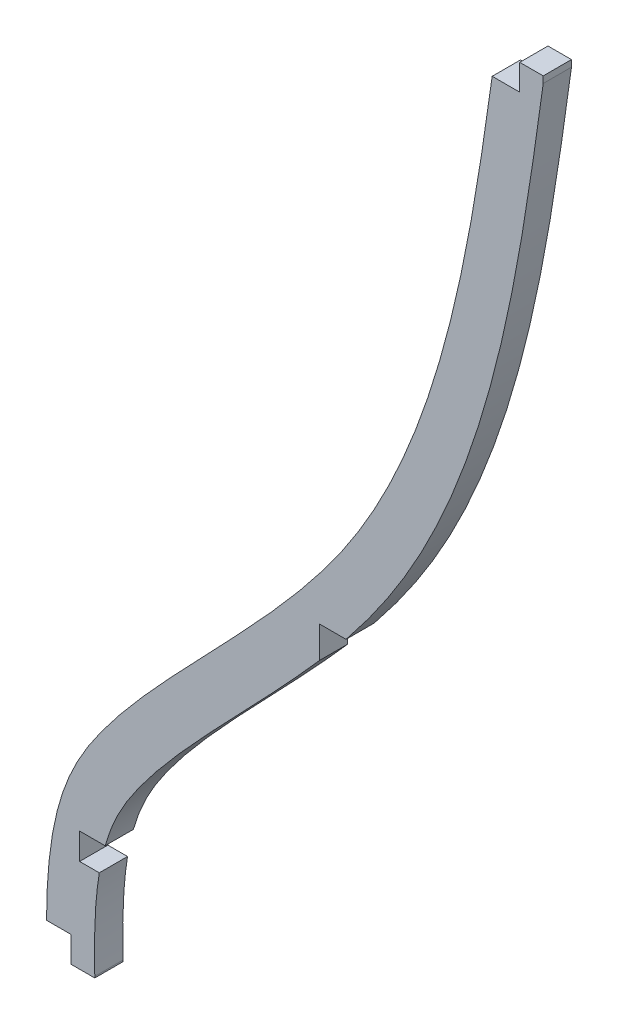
from build123d import *

# Parameters (mm, degrees)
BOSS_EXTRUDE1_DEPTH = 2.9972
SKETCH3_W           = 2.828248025
SKETCH3_H           = 3.360453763
SKETCH3_W_2         = 2.921266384
SKETCH3_H_2         = 2.7432
CUT_EXTRUDE1_DEPTH  = 2.9972


with BuildPart() as part:
    # Sketch2 → Boss-Extrude1 (new body)
    with BuildSketch(Plane.XY):
        with BuildLine():
            Line((-71.122282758, 0.152274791), (-71.122282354, 0))
            Line((-71.122282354, 0), (-76.2, 0))
            add(Edge.make_bspline(
                [(-76.2, 0), (-76.569654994, 12.326423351), (-70.425353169, 26.763478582), (-35.694986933, 54.959288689), (-31.122332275, 88.312292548), (-28.575, 106.68)],
                knots=[0, 0, 0, 0, 0.192928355, 0.526146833, 1, 1, 1, 1], degree=3))
            Line((-28.575, 106.68), (-23.543159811, 106.68))
            Line((-23.543159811, 106.68), (-23.543159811, 105.98215739))
            add(Edge.make_bspline(
                [(-71.122282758, 0.152274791), (-71.136070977, 0.612053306), (-71.156705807, 1.549793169), (-71.164598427, 3.28211812), (-71.116797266, 5.286174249), (-70.973071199, 7.421615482), (-70.676706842, 9.95097976), (-70.130555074, 12.571826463), (-69.245381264, 15.104636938), (-68.120237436, 17.334393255), (-66.672184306, 19.551075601), (-64.863064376, 21.934930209), (-62.11843264, 25.208242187), (-58.137191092, 29.502846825), (-52.85973139, 34.964227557), (-47.448209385, 40.791541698), (-42.251514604, 47.060450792), (-37.691832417, 53.925317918), (-34.064233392, 61.084345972), (-31.169794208, 68.465794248), (-28.900123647, 75.982476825), (-27.122712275, 83.563137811), (-25.715420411, 91.141122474), (-24.75221092, 97.394015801), (-24.048588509, 102.335722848), (-23.712246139, 104.76294926), (-23.543159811, 105.98215739)],
                knots=[0, 0, 0, 0, 0.0078125, 0.015625, 0.03125, 0.046875, 0.0625, 0.09375, 0.125, 0.15625, 0.1875, 0.21875, 0.25, 0.3125, 0.375, 0.4375, 0.5, 0.5625, 0.625, 0.6875, 0.75, 0.8125, 0.875, 0.9375, 0.96875, 1, 1, 1, 1], degree=3))
        make_face()
    extrude(amount=BOSS_EXTRUDE1_DEPTH)

    # Sketch3 → Cut-Extrude1 (cut)
    with BuildSketch(Plane.XY.offset(2.9972)):
        Polygon((-73.66, 0), (-73.66, 2.7432), (-76.239147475, 2.7432), (-76.567195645, 0), align=None)
        Polygon((-70.028476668, 12.7), (-72.729966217, 12.7), (-72.729966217, 9.906), (-70.643031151, 9.906), align=None)
        with Locations((-45.87350761, 42.769773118)):
            Rectangle(SKETCH3_W, SKETCH3_H)
        with Locations((-27.495633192, 105.3084)):
            Rectangle(SKETCH3_W_2, SKETCH3_H_2)
    extrude(amount=-CUT_EXTRUDE1_DEPTH, mode=Mode.SUBTRACT)


solid = part.part
